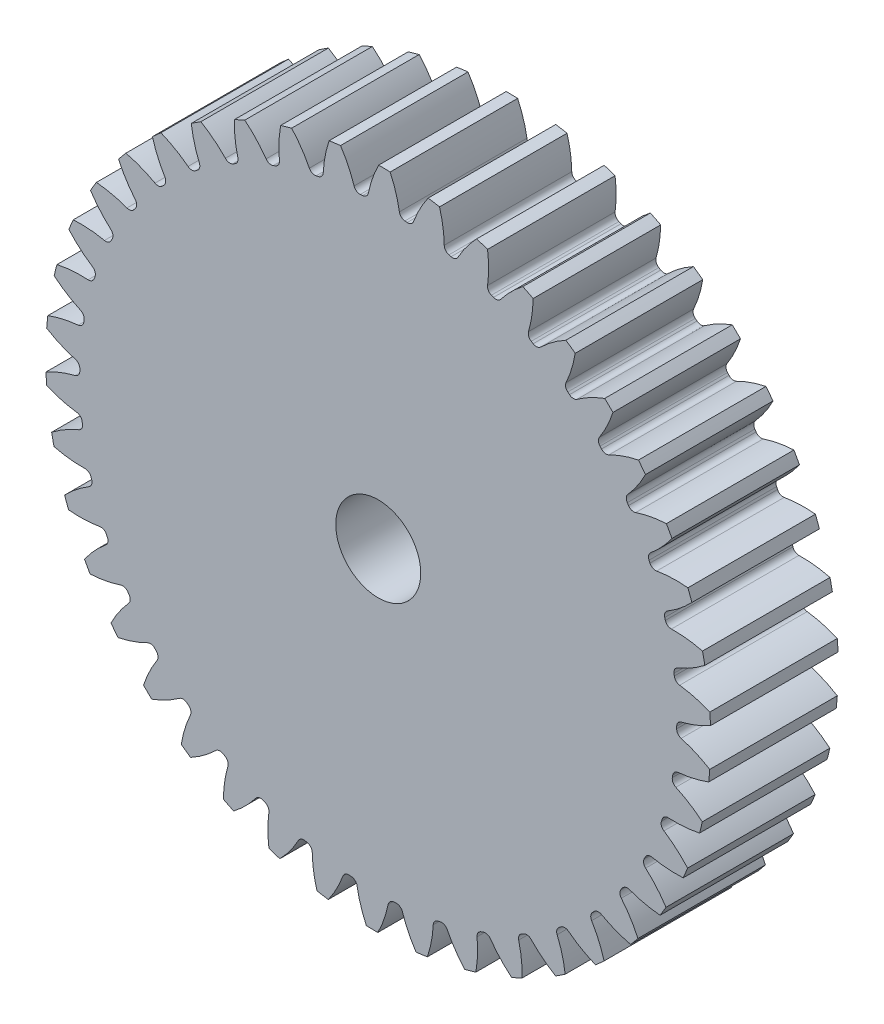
from build123d import *

# Parameters (mm, degrees)
SKETCH3_R         = 248.355555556
GEARBODY_DEPTH    = 95.25
TOOTHCUT_DEPTH    = 364.914174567
CIRPATTERN1_COUNT = 42
BOREDIA_R         = 31.75
BORE_DEPTH        = 12700


with BuildPart() as part:
    # Sketch3 → gearBody (new body)
    with BuildSketch(Plane.XY):
        Circle(SKETCH3_R)
    extrude(amount=GEARBODY_DEPTH)

    # Sketch2 → toothCut (cut, through all)
    with BuildSketch(Plane.XY):
        with BuildLine():
            ThreePointArc((222.900058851, -4.974285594), (222.917366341, -4.126443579), (222.931448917, -3.278541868))
            ThreePointArc((222.931448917, -3.278541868), (223.931574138, -0.483653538), (226.431863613, 1.116410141))
            ThreePointArc((226.431863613, 1.116410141), (237.690312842, 4.705444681), (248.355555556, 9.793317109))
            ThreePointArc((248.355555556, 9.793317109), (248.50599582, -4.60011702), (247.822964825, -18.978122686))
            ThreePointArc((247.822964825, -18.978122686), (237.353328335, -13.499020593), (226.235420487, -9.495775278))
            ThreePointArc((226.235420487, -9.495775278), (223.796061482, -7.804273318), (222.900058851, -4.974285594))
        make_face()
    toothcut = extrude(amount=TOOTHCUT_DEPTH, mode=Mode.SUBTRACT)

    # CirPattern1: toothCut ×42 about axis
    cirpattern1_axis = Axis((0, 0, 0), (0, 0, 1))
    for i in range(1, CIRPATTERN1_COUNT):
        add(toothcut.rotate(cirpattern1_axis, i * 360 / CIRPATTERN1_COUNT), mode=Mode.SUBTRACT)

    # boreDia → bore (cut, symmetric)
    with BuildSketch(Plane.XY):
        Circle(BOREDIA_R)
    extrude(amount=BORE_DEPTH, both=True, mode=Mode.SUBTRACT)


solid = part.part
